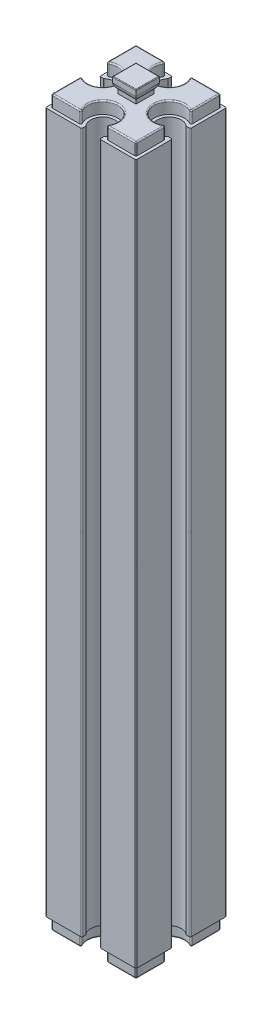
from build123d import *

# Parameters (mm, degrees)
EXTRUDE_1_DEPTH        = 58
EXTRUDE_2_DEPTH        = 2
EXTRUDE_3_DEPTH        = 2
FILLET_3_R             = 0.2
CUT_EXTRUDE_1_DEPTH    = 3
FILLET_4_R             = 0.2
FILLET_5_R             = 0.1
FILLET_3_OF_MIRROR_1_R = 0.2
FILLET_4_OF_MIRROR_1_R = 0.2
FILLET_5_OF_MIRROR_1_R = 0.1


with BuildPart() as part:
    # Sketch 1 → Extrude 1 (new body)
    with BuildSketch(Plane(origin=(0, 0, 0), x_dir=(1, 0, 0), z_dir=(0, 1, 0))):
        with BuildLine():
            Line((-7.5, 7.5), (-1.5, 7.5))
            Line((-1.5, 7.5), (-1.5, 6.822875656))
            ThreePointArc((-1.5, 6.822875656), (0, 3.5), (1.5, 6.822875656))
            Line((1.5, 6.822875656), (1.5, 7.5))
            Line((1.5, 7.5), (7.5, 7.5))
            Line((7.5, 7.5), (7.5, 1.5))
            Line((7.5, 1.5), (6.822875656, 1.5))
            ThreePointArc((6.822875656, 1.5), (3.5, 0), (6.822875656, -1.5))
            Line((6.822875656, -1.5), (7.5, -1.5))
            Line((7.5, -1.5), (7.5, -7.5))
            Line((7.5, -7.5), (1.5, -7.5))
            Line((1.5, -7.5), (1.5, -6.822875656))
            ThreePointArc((1.5, -6.822875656), (0, -3.5), (-1.5, -6.822875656))
            Line((-1.5, -6.822875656), (-1.5, -7.5))
            Line((-1.5, -7.5), (-7.5, -7.5))
            Line((-7.5, -7.5), (-7.5, -1.5))
            Line((-7.5, -1.5), (-6.822875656, -1.5))
            ThreePointArc((-6.822875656, -1.5), (-3.5, 0), (-6.822875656, 1.5))
            Line((-6.822875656, 1.5), (-7.5, 1.5))
            Line((-7.5, 1.5), (-7.5, 7.5))
        make_face()
    extrude_1 = extrude(amount=EXTRUDE_1_DEPTH)

    # Sketch 2 → Extrude 2 (add)
    with BuildSketch(Plane(origin=(0, 58, 0), x_dir=(1, 0, 0), z_dir=(0, 1, 0))):
        with BuildLine():
            Line((-7, 7), (-7, 2))
            ThreePointArc((-7, 2), (-3, 0), (-7, -2))
            Line((-7, -2), (-7, -7))
            Line((-7, -7), (-2, -7))
            ThreePointArc((-2, -7), (0, -3), (2, -7))
            Line((2, -7), (7, -7))
            Line((7, -7), (7, -2))
            ThreePointArc((7, -2), (3, 0), (7, 2))
            Line((7, 2), (7, 7))
            Line((7, 7), (2, 7))
            ThreePointArc((2, 7), (0, 3), (-2, 7))
            Line((-2, 7), (-7, 7))
        make_face()
    extrude_2 = extrude(amount=EXTRUDE_2_DEPTH)

    # Sketch 3 → Extrude 3 (add, symmetric)
    with BuildSketch(Plane(origin=(0, 0, 0), x_dir=(0, 0, -1), z_dir=(1, 0, 0))):
        with BuildLine():
            Line((-1.5, 60), (1.5, 60))
            Line((1.5, 60), (1.5, 60.677124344))
            ThreePointArc((1.5, 60.677124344), (1.780042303, 61.088161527), (1.95, 61.555590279))
            Line((1.95, 61.555590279), (1.95, 62.5))
            Line((1.95, 62.5), (-1.95, 62.5))
            Line((-1.95, 62.5), (-1.95, 61.555590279))
            ThreePointArc((-1.95, 61.555590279), (-1.780042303, 61.088161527), (-1.5, 60.677124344))
            Line((-1.5, 60.677124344), (-1.5, 60))
        make_face()
    extrude_3 = extrude(amount=EXTRUDE_3_DEPTH, both=True)

    # Fillet 3
    fillet_3_edges = [part.edges().sort_by_distance(p)[0] for p in [
        (-7.5, 29, -7.5),
        (-1.5, 29, -7.5),
        (1.5, 29, -7.5),
        (7.5, 29, -7.5),
        (7.5, 29, -1.5),
        (7.5, 29, 1.5),
        (7.5, 29, 7.5),
        (1.5, 29, 7.5),
        (-1.5, 29, 7.5),
        (-7.5, 29, 7.5),
        (-7.5, 29, 1.5),
        (-6.822875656, 29, -1.5),
        (-7.5, 29, -1.5),
    ]]
    fillet(fillet_3_edges, radius=FILLET_3_R)

    # Sketch 4 → Cut-Extrude 1 (cut, symmetric)
    with BuildSketch(Plane.XY):
        with BuildLine():
            Line((1.95, 62.5), (2, 62.5))
            Line((2, 62.5), (2, 60))
            Line((2, 60), (1.5, 60))
            Line((1.5, 60), (1.5, 60.677124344))
            ThreePointArc((1.5, 60.677124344), (1.780042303, 61.088161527), (1.95, 61.555590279))
            Line((1.95, 61.555590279), (1.95, 62.5))
        make_face()
        with BuildLine():
            Line((-1.95, 62.5), (-1.95, 61.555590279))
            ThreePointArc((-1.95, 61.555590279), (-1.780042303, 61.088161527), (-1.5, 60.677124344))
            Line((-1.5, 60.677124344), (-1.5, 60))
            Line((-1.5, 60), (-2, 60))
            Line((-2, 60), (-2, 62.5))
            Line((-2, 62.5), (-1.95, 62.5))
        make_face()
    cut_extrude_1 = extrude(amount=CUT_EXTRUDE_1_DEPTH, both=True, mode=Mode.SUBTRACT)

    # Fillet 4
    fillet_4_edges = [part.edges().sort_by_distance(p)[0] for p in [
        (-2, 59, -7),
        (-7, 59, -7),
        (-7, 59, -2),
        (-7, 59, 2),
        (-7, 59, 7),
        (-2, 59, 7),
        (2, 59, 7),
        (7, 59, 7),
        (7, 59, 2),
        (7, 59, -2),
        (7, 59, -7),
        (2, 59, -7),
        (-4.5, 60, -7),
        (-7, 60, -4.5),
        (-3, 60, 0),
        (-7, 60, 4.5),
        (-4.5, 60, 7),
        (0, 60, 3),
        (4.5, 60, 7),
        (7, 60, 4.5),
        (3, 60, 0),
        (7, 60, -4.5),
        (4.5, 60, -7),
        (0, 60, -3),
    ]]
    fillet(fillet_4_edges, radius=FILLET_4_R)

    # Fillet 5
    fillet_5_edges = [part.edges().sort_by_distance(p)[0] for p in [
        (1.95, 62.5, 0),
        (0, 62.5, -1.95),
        (0, 62.5, 1.95),
        (-1.95, 62.5, 0),
    ]]
    fillet(fillet_5_edges, radius=FILLET_5_R)


with BuildPart() as mirror_1_1:
    # Mirror 1: Extrude 1, Extrude 2, Extrude 3 across Top Plane
    add(extrude_1.mirror(Plane(origin=(0, 0, 0), x_dir=(1, 0, 0), z_dir=(0, 1, 0))))
    add(extrude_2.mirror(Plane(origin=(0, 0, 0), x_dir=(1, 0, 0), z_dir=(0, 1, 0))))
    add(extrude_3.mirror(Plane(origin=(0, 0, 0), x_dir=(1, 0, 0), z_dir=(0, 1, 0))))

    # Mirror 1 2: Cut-Extrude 1 across Top Plane
    add(cut_extrude_1.mirror(Plane(origin=(0, 0, 0), x_dir=(1, 0, 0), z_dir=(0, 1, 0))), mode=Mode.SUBTRACT)

    # Fillet 3 of Mirror 1
    fillet_3_of_mirror_1_edges = [mirror_1_1.edges().sort_by_distance(p)[0] for p in [
        (-7.5, -29, -7.5),
        (-1.5, -29, -7.5),
        (1.5, -29, -7.5),
        (7.5, -29, -7.5),
        (7.5, -29, -1.5),
        (7.5, -29, 1.5),
        (7.5, -29, 7.5),
        (1.5, -29, 7.5),
        (-1.5, -29, 7.5),
        (-7.5, -29, 7.5),
        (-7.5, -29, 1.5),
        (-6.822875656, -29, -1.5),
        (-7.5, -29, -1.5),
    ]]
    fillet(fillet_3_of_mirror_1_edges, radius=FILLET_3_OF_MIRROR_1_R)

    # Fillet 4 of Mirror 1
    fillet_4_of_mirror_1_edges = [mirror_1_1.edges().sort_by_distance(p)[0] for p in [
        (-2, -59, -7),
        (-7, -59, -7),
        (-7, -59, -2),
        (-7, -59, 2),
        (-7, -59, 7),
        (-2, -59, 7),
        (2, -59, 7),
        (7, -59, 7),
        (7, -59, 2),
        (7, -59, -2),
        (7, -59, -7),
        (2, -59, -7),
        (-4.5, -60, -7),
        (-7, -60, -4.5),
        (-3, -60, 0),
        (-7, -60, 4.5),
        (-4.5, -60, 7),
        (0, -60, 3),
        (4.5, -60, 7),
        (7, -60, 4.5),
        (3, -60, 0),
        (7, -60, -4.5),
        (4.5, -60, -7),
        (0, -60, -3),
    ]]
    fillet(fillet_4_of_mirror_1_edges, radius=FILLET_4_OF_MIRROR_1_R)

    # Fillet 5 of Mirror 1
    fillet_5_of_mirror_1_edges = [mirror_1_1.edges().sort_by_distance(p)[0] for p in [
        (1.95, -62.5, 0),
        (0, -62.5, -1.95),
        (0, -62.5, 1.95),
        (-1.95, -62.5, 0),
    ]]
    fillet(fillet_5_of_mirror_1_edges, radius=FILLET_5_OF_MIRROR_1_R)


with BuildPart() as part_1:
    add(part.part)

    # Mirror 1 united with what the copies tou: union Mirror 1_1
    add(mirror_1_1.part)


solid = part_1.part
